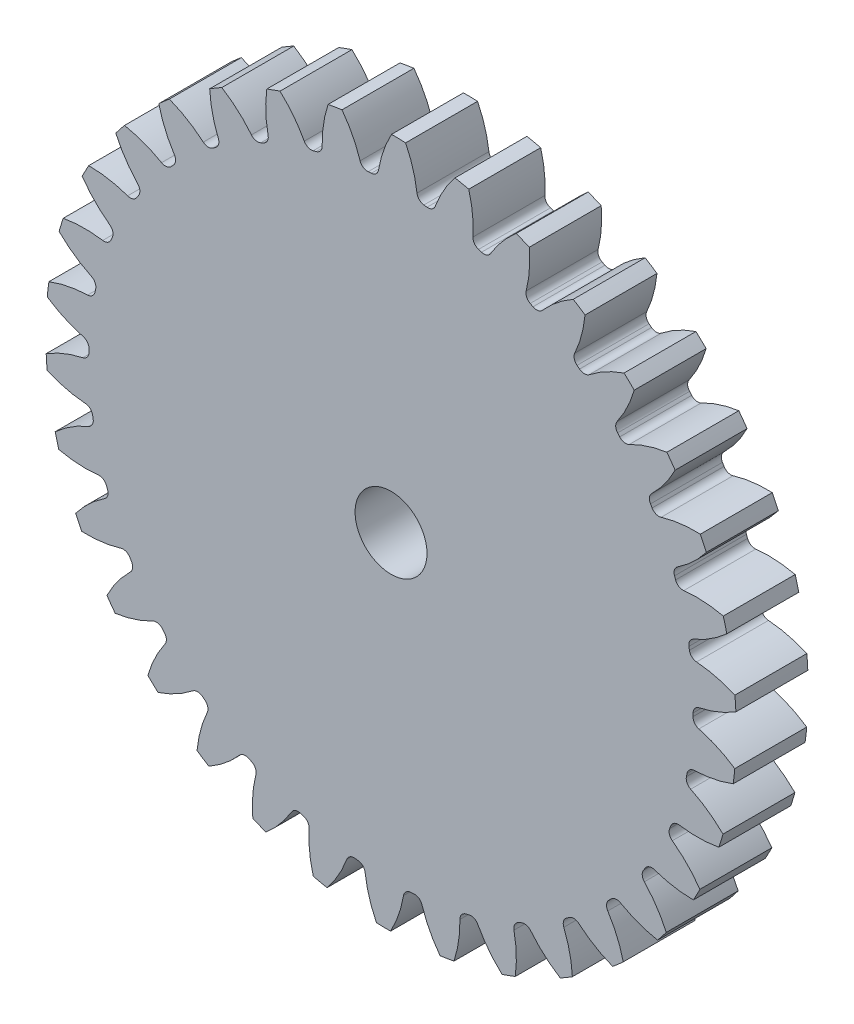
from build123d import *

# Parameters (mm, degrees)
SKETCH3_R         = 609.6
GEARBODY_DEPTH    = 127
TOOTHCUT_DEPTH    = 872.408813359
CIRPATTERN1_COUNT = 34
BOREDIA_R         = 63.5
BORE_DEPTH        = 12700


with BuildPart() as part:
    # Sketch3 → gearBody (new body)
    with BuildSketch(Plane.XY):
        Circle(SKETCH3_R)
    extrude(amount=GEARBODY_DEPTH)

    # Sketch2 → toothCut (cut, through all)
    with BuildSketch(Plane.XY):
        with BuildLine():
            ThreePointArc((533.203651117, -14.471573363), (533.272587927, -11.657914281), (533.326677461, -8.843930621))
            ThreePointArc((533.326677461, -8.843930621), (536.442856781, -0.341202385), (544.162711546, 4.392802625))
            ThreePointArc((544.162711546, 4.392802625), (578.023451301, 14.902021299), (609.6, 31.02389917))
            ThreePointArc((609.6, 31.02389917), (610.243124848, -13.340573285), (607.66183048, -57.634556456))
            ThreePointArc((607.66183048, -57.634556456), (576.819995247, -40.14814535), (543.450870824, -28.169209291))
            ThreePointArc((543.450870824, -28.169209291), (535.945273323, -23.102359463), (533.203651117, -14.471573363))
        make_face()
    toothcut = extrude(amount=TOOTHCUT_DEPTH, mode=Mode.SUBTRACT)

    # CirPattern1: toothCut ×34 about axis
    cirpattern1_axis = Axis((0, 0, 0), (0, 0, 1))
    for i in range(1, CIRPATTERN1_COUNT):
        add(toothcut.rotate(cirpattern1_axis, i * 360 / CIRPATTERN1_COUNT), mode=Mode.SUBTRACT)

    # boreDia → bore (cut, symmetric)
    with BuildSketch(Plane.XY):
        Circle(BOREDIA_R)
    extrude(amount=BORE_DEPTH, both=True, mode=Mode.SUBTRACT)


solid = part.part
